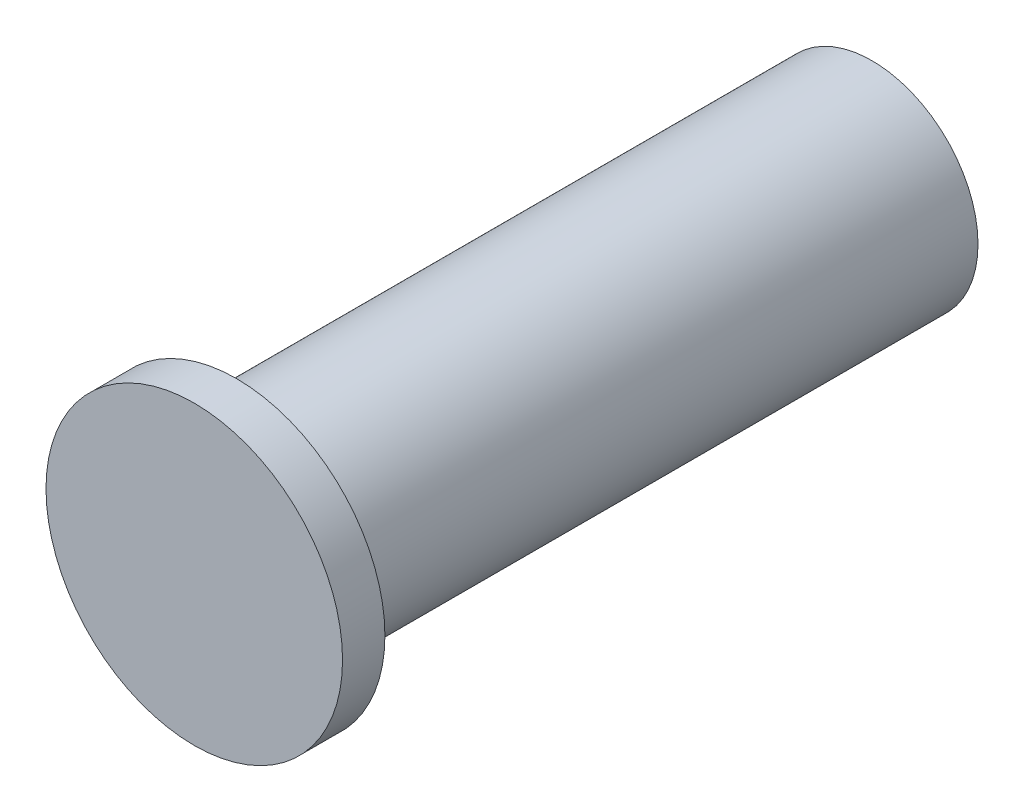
ISO-10303-21;
HEADER;
FILE_DESCRIPTION(('STEP AP214'),'2;1');
FILE_NAME('part.step','',(''),(''),'','','');
FILE_SCHEMA(('AUTOMOTIVE_DESIGN { 1 0 10303 214 1 1 1 1 }'));
ENDSEC;
DATA;
#1=APPLICATION_CONTEXT('core data for automotive mechanical design processes');
#2=APPLICATION_PROTOCOL_DEFINITION('international standard','automotive_design',2000,#1);
#3=PRODUCT_CONTEXT('',#1,'mechanical');
#4=PRODUCT('Part','Part','',(#3));
#5=PRODUCT_RELATED_PRODUCT_CATEGORY('part','',(#4));
#6=PRODUCT_DEFINITION_FORMATION('','',#4);
#7=PRODUCT_DEFINITION_CONTEXT('part definition',#1,'design');
#8=PRODUCT_DEFINITION('design','',#6,#7);
#9=PRODUCT_DEFINITION_SHAPE('','',#8);
#10=(LENGTH_UNIT() NAMED_UNIT(*) SI_UNIT(.MILLI.,.METRE.));
#11=(NAMED_UNIT(*) PLANE_ANGLE_UNIT() SI_UNIT($,.RADIAN.));
#12=(NAMED_UNIT(*) SI_UNIT($,.STERADIAN.) SOLID_ANGLE_UNIT());
#13=UNCERTAINTY_MEASURE_WITH_UNIT(LENGTH_MEASURE(1.E-05),#10,'distance_accuracy_value','');
#14=(GEOMETRIC_REPRESENTATION_CONTEXT(3) GLOBAL_UNCERTAINTY_ASSIGNED_CONTEXT((#13)) GLOBAL_UNIT_ASSIGNED_CONTEXT((#10,
#11,#12)) REPRESENTATION_CONTEXT('',''));
#15=CARTESIAN_POINT('',(0.,0.,0.));
#16=DIRECTION('',(0.,0.,1.));
#17=DIRECTION('',(1.,0.,0.));
#18=AXIS2_PLACEMENT_3D('',#15,#16,#17);
#19=CARTESIAN_POINT('',(0.,0.,-7.62));
#20=DIRECTION('',(0.,0.,1.));
#21=DIRECTION('',(1.,0.,0.));
#22=AXIS2_PLACEMENT_3D('',#19,#20,#21);
#23=CYLINDRICAL_SURFACE('',#22,1.27000000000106);
#24=CARTESIAN_POINT('',(0.,0.,-7.62));
#25=DIRECTION('',(0.,0.,1.));
#26=DIRECTION('',(1.,0.,0.));
#27=AXIS2_PLACEMENT_3D('',#24,#25,#26);
#28=CIRCLE('',#27,1.27000000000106);
#29=CARTESIAN_POINT('',(1.27000000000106,0.,-7.62));
#30=VERTEX_POINT('',#29);
#31=EDGE_CURVE('E10',#30,#30,#28,.T.);
#32=CARTESIAN_POINT('',(0.,0.,0.));
#33=DIRECTION('',(0.,0.,1.));
#34=DIRECTION('',(1.,0.,0.));
#35=AXIS2_PLACEMENT_3D('',#32,#33,#34);
#36=CIRCLE('',#35,1.27000000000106);
#37=CARTESIAN_POINT('',(1.27000000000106,0.,0.));
#38=VERTEX_POINT('',#37);
#39=EDGE_CURVE('E34',#38,#38,#36,.T.);
#40=CARTESIAN_POINT('',(1.27000000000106,0.,-7.62));
#41=CARTESIAN_POINT('',(1.27000000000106,0.,-7.540625));
#42=CARTESIAN_POINT('',(1.27000000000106,0.,-7.46125));
#43=CARTESIAN_POINT('',(1.27000000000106,0.,-7.3025));
#44=CARTESIAN_POINT('',(1.27000000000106,0.,-7.223125));
#45=CARTESIAN_POINT('',(1.27000000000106,0.,-7.064375));
#46=CARTESIAN_POINT('',(1.27000000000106,0.,-6.985));
#47=CARTESIAN_POINT('',(1.27000000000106,0.,-6.82625));
#48=CARTESIAN_POINT('',(1.27000000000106,0.,-6.746875));
#49=CARTESIAN_POINT('',(1.27000000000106,0.,-6.588125));
#50=CARTESIAN_POINT('',(1.27000000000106,0.,-6.50875));
#51=CARTESIAN_POINT('',(1.27000000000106,0.,-6.35));
#52=CARTESIAN_POINT('',(1.27000000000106,0.,-6.270625));
#53=CARTESIAN_POINT('',(1.27000000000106,0.,-6.111875));
#54=CARTESIAN_POINT('',(1.27000000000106,0.,-6.0325));
#55=CARTESIAN_POINT('',(1.27000000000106,0.,-5.87375));
#56=CARTESIAN_POINT('',(1.27000000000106,0.,-5.794375));
#57=CARTESIAN_POINT('',(1.27000000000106,0.,-5.635625));
#58=CARTESIAN_POINT('',(1.27000000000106,0.,-5.55625));
#59=CARTESIAN_POINT('',(1.27000000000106,0.,-5.3975));
#60=CARTESIAN_POINT('',(1.27000000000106,0.,-5.318125));
#61=CARTESIAN_POINT('',(1.27000000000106,0.,-5.159375));
#62=CARTESIAN_POINT('',(1.27000000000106,0.,-5.08));
#63=CARTESIAN_POINT('',(1.27000000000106,0.,-4.92125));
#64=CARTESIAN_POINT('',(1.27000000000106,0.,-4.841875));
#65=CARTESIAN_POINT('',(1.27000000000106,0.,-4.683125));
#66=CARTESIAN_POINT('',(1.27000000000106,0.,-4.60375));
#67=CARTESIAN_POINT('',(1.27000000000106,0.,-4.445));
#68=CARTESIAN_POINT('',(1.27000000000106,0.,-4.365625));
#69=CARTESIAN_POINT('',(1.27000000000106,0.,-4.206875));
#70=CARTESIAN_POINT('',(1.27000000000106,0.,-4.1275));
#71=CARTESIAN_POINT('',(1.27000000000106,0.,-3.96875));
#72=CARTESIAN_POINT('',(1.27000000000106,0.,-3.889375));
#73=CARTESIAN_POINT('',(1.27000000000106,0.,-3.730625));
#74=CARTESIAN_POINT('',(1.27000000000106,0.,-3.65125));
#75=CARTESIAN_POINT('',(1.27000000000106,0.,-3.4925));
#76=CARTESIAN_POINT('',(1.27000000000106,0.,-3.413125));
#77=CARTESIAN_POINT('',(1.27000000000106,0.,-3.254375));
#78=CARTESIAN_POINT('',(1.27000000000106,0.,-3.175));
#79=CARTESIAN_POINT('',(1.27000000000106,0.,-3.01625));
#80=CARTESIAN_POINT('',(1.27000000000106,0.,-2.936875));
#81=CARTESIAN_POINT('',(1.27000000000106,0.,-2.778125));
#82=CARTESIAN_POINT('',(1.27000000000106,0.,-2.69875));
#83=CARTESIAN_POINT('',(1.27000000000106,0.,-2.54));
#84=CARTESIAN_POINT('',(1.27000000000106,0.,-2.460625));
#85=CARTESIAN_POINT('',(1.27000000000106,0.,-2.301875));
#86=CARTESIAN_POINT('',(1.27000000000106,0.,-2.2225));
#87=CARTESIAN_POINT('',(1.27000000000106,0.,-2.06375));
#88=CARTESIAN_POINT('',(1.27000000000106,0.,-1.984375));
#89=CARTESIAN_POINT('',(1.27000000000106,0.,-1.825625));
#90=CARTESIAN_POINT('',(1.27000000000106,0.,-1.74625));
#91=CARTESIAN_POINT('',(1.27000000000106,0.,-1.5875));
#92=CARTESIAN_POINT('',(1.27000000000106,0.,-1.508125));
#93=CARTESIAN_POINT('',(1.27000000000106,0.,-1.349375));
#94=CARTESIAN_POINT('',(1.27000000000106,0.,-1.27));
#95=CARTESIAN_POINT('',(1.27000000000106,0.,-1.11125));
#96=CARTESIAN_POINT('',(1.27000000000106,0.,-1.031875));
#97=CARTESIAN_POINT('',(1.27000000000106,0.,-0.873125));
#98=CARTESIAN_POINT('',(1.27000000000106,0.,-0.79375));
#99=CARTESIAN_POINT('',(1.27000000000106,0.,-0.635));
#100=CARTESIAN_POINT('',(1.27000000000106,0.,-0.555625));
#101=CARTESIAN_POINT('',(1.27000000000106,0.,-0.396875));
#102=CARTESIAN_POINT('',(1.27000000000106,0.,-0.3175));
#103=CARTESIAN_POINT('',(1.27000000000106,0.,-0.15875));
#104=CARTESIAN_POINT('',(1.27000000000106,0.,-0.0793749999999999));
#105=CARTESIAN_POINT('',(1.27000000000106,0.,0.));
#106=B_SPLINE_CURVE_WITH_KNOTS('',3,(#40,#41,#42,#43,#44,#45,#46,#47,#48,#49,#50,#51,#52,#53,
#54,#55,#56,#57,#58,#59,#60,#61,#62,#63,#64,#65,#66,#67,#68,#69,#70,#71,#72,#73,#74,#75,#76,#77,
#78,#79,#80,#81,#82,#83,#84,#85,#86,#87,#88,#89,#90,#91,#92,#93,#94,#95,#96,#97,#98,#99,#100,
#101,#102,#103,#104,#105),.UNSPECIFIED.,.F.,.F.,(4,2,2,2,2,2,2,2,2,2,2,2,2,2,2,2,2,2,2,2,2,2,2,
2,2,2,2,2,2,2,2,2,4),(0.,0.238125,0.47625,0.714375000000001,0.9525,1.190625,1.42875,1.666875,
1.905,2.143125,2.38125,2.619375,2.8575,3.095625,3.33375,3.571875,3.81,4.048125,4.28625,4.524375,
4.7625,5.000625,5.23875,5.476875,5.715,5.953125,6.19125,6.429375,6.6675,6.905625,7.14375,
7.381875,7.62),.UNSPECIFIED.);
#107=EDGE_CURVE('BSEAM31',#30,#38,#106,.T.);
#108=ORIENTED_EDGE('',*,*,#31,.T.);
#109=ORIENTED_EDGE('',*,*,#39,.F.);
#110=ORIENTED_EDGE('',*,*,#107,.T.);
#111=ORIENTED_EDGE('',*,*,#107,.F.);
#112=EDGE_LOOP('',(#108,#110,#109,#111));
#113=FACE_BOUND('',#112,.T.);
#114=ADVANCED_FACE('F31',(#113),#23,.T.);
#115=CARTESIAN_POINT('',(0.,0.,-7.62));
#116=DIRECTION('',(0.,0.,1.));
#117=DIRECTION('',(1.,0.,0.));
#118=AXIS2_PLACEMENT_3D('',#115,#116,#117);
#119=PLANE('',#118);
#120=ORIENTED_EDGE('',*,*,#31,.F.);
#121=EDGE_LOOP('',(#120));
#122=FACE_BOUND('',#121,.T.);
#123=ADVANCED_FACE('F54',(#122),#119,.F.);
#124=CARTESIAN_POINT('',(0.,0.,0.508));
#125=DIRECTION('',(0.,0.,-1.));
#126=DIRECTION('',(-1.,0.,0.));
#127=AXIS2_PLACEMENT_3D('',#124,#125,#126);
#128=CYLINDRICAL_SURFACE('',#127,1.778);
#129=CARTESIAN_POINT('',(0.,0.,0.508));
#130=DIRECTION('',(0.,0.,1.));
#131=DIRECTION('',(1.,0.,0.));
#132=AXIS2_PLACEMENT_3D('',#129,#130,#131);
#133=CIRCLE('',#132,1.778);
#134=CARTESIAN_POINT('',(1.778,0.,0.508));
#135=VERTEX_POINT('',#134);
#136=EDGE_CURVE('E41',#135,#135,#133,.T.);
#137=ORIENTED_EDGE('',*,*,#136,.F.);
#138=EDGE_LOOP('',(#137));
#139=FACE_BOUND('',#138,.T.);
#140=CARTESIAN_POINT('',(0.,0.,0.));
#141=DIRECTION('',(0.,0.,1.));
#142=DIRECTION('',(1.,0.,0.));
#143=AXIS2_PLACEMENT_3D('',#140,#141,#142);
#144=CIRCLE('',#143,1.778);
#145=CARTESIAN_POINT('',(1.778,0.,0.));
#146=VERTEX_POINT('',#145);
#147=EDGE_CURVE('E43',#146,#146,#144,.T.);
#148=ORIENTED_EDGE('',*,*,#147,.T.);
#149=EDGE_LOOP('',(#148));
#150=FACE_BOUND('',#149,.T.);
#151=ADVANCED_FACE('F51',(#139,#150),#128,.T.);
#152=CARTESIAN_POINT('',(0.,0.,0.508));
#153=DIRECTION('',(0.,0.,1.));
#154=DIRECTION('',(1.,0.,0.));
#155=AXIS2_PLACEMENT_3D('',#152,#153,#154);
#156=PLANE('',#155);
#157=ORIENTED_EDGE('',*,*,#136,.T.);
#158=EDGE_LOOP('',(#157));
#159=FACE_BOUND('',#158,.T.);
#160=ADVANCED_FACE('F49',(#159),#156,.T.);
#161=CARTESIAN_POINT('',(0.,0.,0.));
#162=DIRECTION('',(0.,0.,1.));
#163=DIRECTION('',(1.,0.,0.));
#164=AXIS2_PLACEMENT_3D('',#161,#162,#163);
#165=PLANE('',#164);
#166=ORIENTED_EDGE('',*,*,#39,.T.);
#167=EDGE_LOOP('',(#166));
#168=FACE_BOUND('',#167,.T.);
#169=ORIENTED_EDGE('',*,*,#147,.F.);
#170=EDGE_LOOP('',(#169));
#171=FACE_BOUND('',#170,.T.);
#172=ADVANCED_FACE('F58',(#168,#171),#165,.F.);
#173=CLOSED_SHELL('',(#114,#123,#151,#160,#172));
#174=MANIFOLD_SOLID_BREP('B2',#173);
#175=ADVANCED_BREP_SHAPE_REPRESENTATION('',(#18,#174),#14);
#176=SHAPE_DEFINITION_REPRESENTATION(#9,#175);
ENDSEC;
END-ISO-10303-21;
